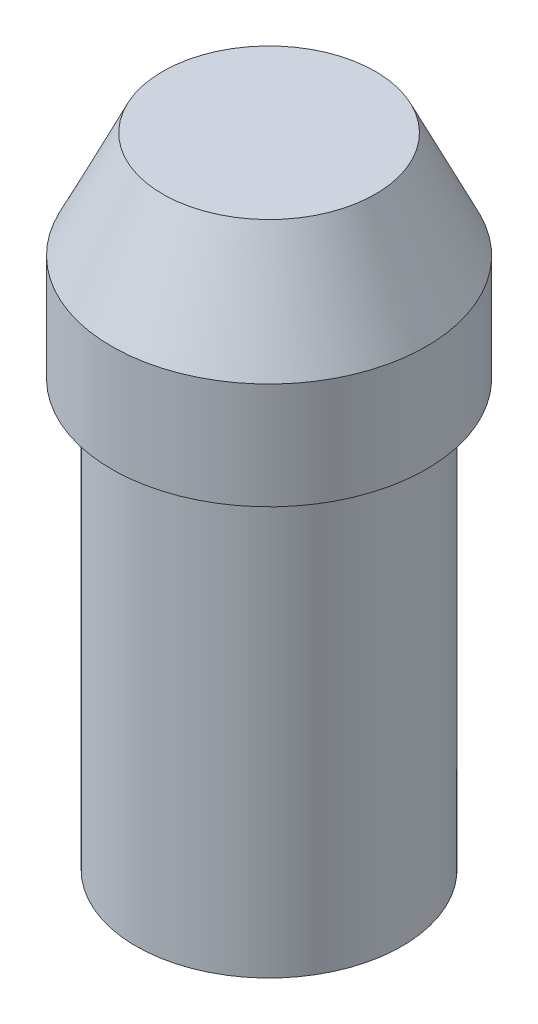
from build123d import *


with BuildPart() as part:
    # Sketch1 → Revolve1 (revolve)
    with BuildSketch(Plane.XY, mode=Mode.PRIVATE) as revolve1_sk:
        Polygon((0, 6.35), (0, -12.7), (3.96875, -12.7), (3.96875, 0), (4.699, 0), (4.699, 3.175), (3.175, 6.35), align=None)
    revolve(revolve1_sk.sketch.rotate(Axis((0, -12.7, 0), (0, -1, 0)), 180), axis=Axis((0, -12.7, 0), (0, -1, 0)))


solid = part.part
